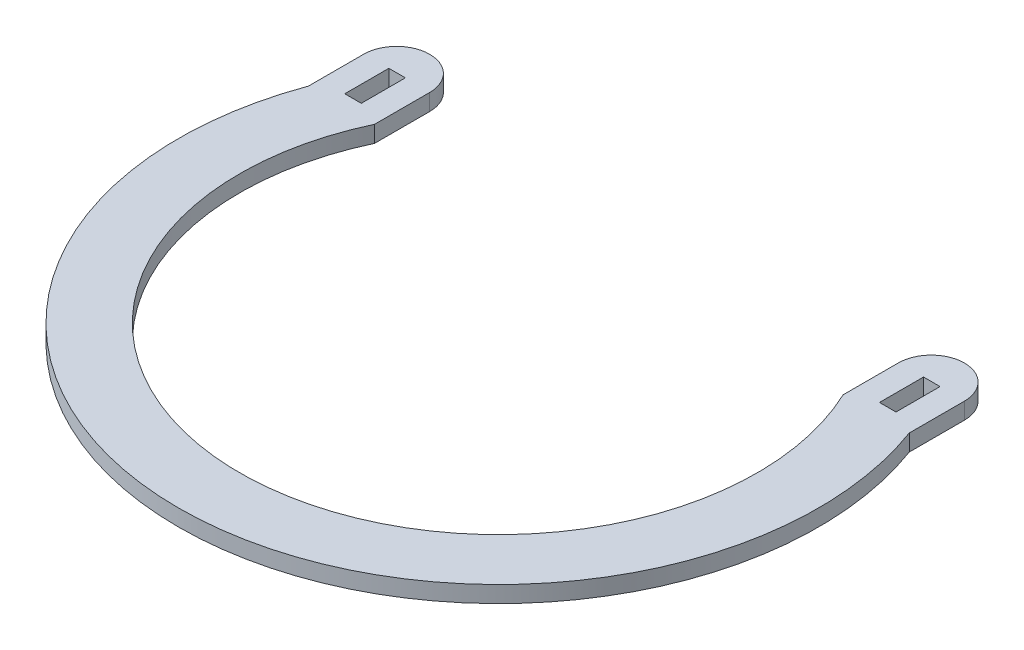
ISO-10303-21;
HEADER;
FILE_DESCRIPTION(('STEP AP214'),'2;1');
FILE_NAME('part.step','',(''),(''),'','','');
FILE_SCHEMA(('AUTOMOTIVE_DESIGN { 1 0 10303 214 1 1 1 1 }'));
ENDSEC;
DATA;
#1=APPLICATION_CONTEXT('core data for automotive mechanical design processes');
#2=APPLICATION_PROTOCOL_DEFINITION('international standard','automotive_design',2000,#1);
#3=PRODUCT_CONTEXT('',#1,'mechanical');
#4=PRODUCT('Part','Part','',(#3));
#5=PRODUCT_RELATED_PRODUCT_CATEGORY('part','',(#4));
#6=PRODUCT_DEFINITION_FORMATION('','',#4);
#7=PRODUCT_DEFINITION_CONTEXT('part definition',#1,'design');
#8=PRODUCT_DEFINITION('design','',#6,#7);
#9=PRODUCT_DEFINITION_SHAPE('','',#8);
#10=(LENGTH_UNIT() NAMED_UNIT(*) SI_UNIT(.MILLI.,.METRE.));
#11=(NAMED_UNIT(*) PLANE_ANGLE_UNIT() SI_UNIT($,.RADIAN.));
#12=(NAMED_UNIT(*) SI_UNIT($,.STERADIAN.) SOLID_ANGLE_UNIT());
#13=UNCERTAINTY_MEASURE_WITH_UNIT(LENGTH_MEASURE(1.E-05),#10,'distance_accuracy_value','');
#14=(GEOMETRIC_REPRESENTATION_CONTEXT(3) GLOBAL_UNCERTAINTY_ASSIGNED_CONTEXT((#13)) GLOBAL_UNIT_ASSIGNED_CONTEXT((#10,
#11,#12)) REPRESENTATION_CONTEXT('',''));
#15=CARTESIAN_POINT('',(0.,0.,0.));
#16=DIRECTION('',(0.,0.,1.));
#17=DIRECTION('',(1.,0.,0.));
#18=AXIS2_PLACEMENT_3D('',#15,#16,#17);
#19=CARTESIAN_POINT('',(-48.5,3.,-30.013068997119));
#20=DIRECTION('',(0.,-1.,0.));
#21=DIRECTION('',(0.,0.,-1.));
#22=AXIS2_PLACEMENT_3D('',#19,#20,#21);
#23=PLANE('',#22);
#24=DIRECTION('',(1.,0.,0.));
#25=VECTOR('',#24,1.);
#26=CARTESIAN_POINT('',(47.0000000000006,3.,-22.1046948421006));
#27=LINE('',#26,#25);
#28=CARTESIAN_POINT('',(47.0000000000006,3.,-22.1046948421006));
#29=VERTEX_POINT('',#28);
#30=CARTESIAN_POINT('',(50.0000000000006,3.,-22.1046948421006));
#31=VERTEX_POINT('',#30);
#32=EDGE_CURVE('E181',#29,#31,#27,.T.);
#33=ORIENTED_EDGE('',*,*,#32,.F.);
#34=DIRECTION('',(0.,0.,1.));
#35=VECTOR('',#34,1.);
#36=CARTESIAN_POINT('',(47.0000000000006,3.,-22.1046948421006));
#37=LINE('',#36,#35);
#38=CARTESIAN_POINT('',(47.0000000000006,3.,-30.1046948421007));
#39=VERTEX_POINT('',#38);
#40=EDGE_CURVE('E189',#39,#29,#37,.T.);
#41=ORIENTED_EDGE('',*,*,#40,.F.);
#42=DIRECTION('',(-1.,0.,0.));
#43=VECTOR('',#42,1.);
#44=CARTESIAN_POINT('',(47.0000000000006,3.,-30.1046948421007));
#45=LINE('',#44,#43);
#46=CARTESIAN_POINT('',(50.0000000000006,3.,-30.1046948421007));
#47=VERTEX_POINT('',#46);
#48=EDGE_CURVE('E186',#47,#39,#45,.T.);
#49=ORIENTED_EDGE('',*,*,#48,.F.);
#50=DIRECTION('',(0.,0.,-1.));
#51=VECTOR('',#50,1.);
#52=CARTESIAN_POINT('',(50.0000000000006,3.,-22.1046948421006));
#53=LINE('',#52,#51);
#54=EDGE_CURVE('E183',#31,#47,#53,.T.);
#55=ORIENTED_EDGE('',*,*,#54,.F.);
#56=EDGE_LOOP('',(#33,#41,#49,#55));
#57=FACE_BOUND('',#56,.T.);
#58=CARTESIAN_POINT('',(-48.5,3.,-30.013068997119));
#59=DIRECTION('',(0.,1.,0.));
#60=DIRECTION('',(0.,0.,-1.));
#61=AXIS2_PLACEMENT_3D('',#58,#59,#60);
#62=CIRCLE('',#61,6.);
#63=CARTESIAN_POINT('',(-42.5,3.,-30.013068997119));
#64=VERTEX_POINT('',#63);
#65=CARTESIAN_POINT('',(-54.5,3.,-30.013068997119));
#66=VERTEX_POINT('',#65);
#67=EDGE_CURVE('E212',#64,#66,#62,.T.);
#68=ORIENTED_EDGE('',*,*,#67,.T.);
#69=DIRECTION('',(0.,0.,1.));
#70=VECTOR('',#69,1.);
#71=CARTESIAN_POINT('',(-54.5,3.,-20.013068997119));
#72=LINE('',#71,#70);
#73=CARTESIAN_POINT('',(-54.5000000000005,3.,-20.0130689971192));
#74=VERTEX_POINT('',#73);
#75=EDGE_CURVE('E215',#66,#74,#72,.T.);
#76=ORIENTED_EDGE('',*,*,#75,.T.);
#77=CARTESIAN_POINT('',(0.,3.,0.));
#78=DIRECTION('',(0.,1.,0.));
#79=DIRECTION('',(0.,0.,1.));
#80=AXIS2_PLACEMENT_3D('',#77,#78,#79);
#81=CIRCLE('',#80,58.0583579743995);
#82=CARTESIAN_POINT('',(54.5000000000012,3.,-20.013068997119));
#83=VERTEX_POINT('',#82);
#84=EDGE_CURVE('E218',#74,#83,#81,.T.);
#85=ORIENTED_EDGE('',*,*,#84,.T.);
#86=DIRECTION('',(0.,0.,-1.));
#87=VECTOR('',#86,1.);
#88=CARTESIAN_POINT('',(54.5000000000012,3.,-20.013068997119));
#89=LINE('',#88,#87);
#90=CARTESIAN_POINT('',(54.5000000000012,3.,-30.013068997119));
#91=VERTEX_POINT('',#90);
#92=EDGE_CURVE('E220',#83,#91,#89,.T.);
#93=ORIENTED_EDGE('',*,*,#92,.T.);
#94=CARTESIAN_POINT('',(48.5000000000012,3.,-30.013068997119));
#95=DIRECTION('',(0.,1.,0.));
#96=DIRECTION('',(0.,0.,1.));
#97=AXIS2_PLACEMENT_3D('',#94,#95,#96);
#98=CIRCLE('',#97,6.);
#99=CARTESIAN_POINT('',(42.5000000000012,3.,-30.013068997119));
#100=VERTEX_POINT('',#99);
#101=EDGE_CURVE('E222',#91,#100,#98,.T.);
#102=ORIENTED_EDGE('',*,*,#101,.T.);
#103=DIRECTION('',(0.,0.,1.));
#104=VECTOR('',#103,1.);
#105=CARTESIAN_POINT('',(42.5000000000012,3.,-30.013068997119));
#106=LINE('',#105,#104);
#107=CARTESIAN_POINT('',(42.5000000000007,3.,-20.0130689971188));
#108=VERTEX_POINT('',#107);
#109=EDGE_CURVE('E224',#100,#108,#106,.T.);
#110=ORIENTED_EDGE('',*,*,#109,.T.);
#111=CARTESIAN_POINT('',(0.,3.,0.));
#112=DIRECTION('',(0.,-1.,0.));
#113=DIRECTION('',(0.,0.,1.));
#114=AXIS2_PLACEMENT_3D('',#111,#112,#113);
#115=CIRCLE('',#114,46.9763017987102);
#116=CARTESIAN_POINT('',(-42.5,3.,-20.013068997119));
#117=VERTEX_POINT('',#116);
#118=EDGE_CURVE('E226',#108,#117,#115,.T.);
#119=ORIENTED_EDGE('',*,*,#118,.T.);
#120=DIRECTION('',(0.,0.,-1.));
#121=VECTOR('',#120,1.);
#122=CARTESIAN_POINT('',(-42.5,3.,-30.013068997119));
#123=LINE('',#122,#121);
#124=EDGE_CURVE('E228',#117,#64,#123,.T.);
#125=ORIENTED_EDGE('',*,*,#124,.T.);
#126=EDGE_LOOP('',(#68,#76,#85,#93,#102,#110,#119,#125));
#127=FACE_BOUND('',#126,.T.);
#128=DIRECTION('',(0.,0.,-1.));
#129=VECTOR('',#128,1.);
#130=CARTESIAN_POINT('',(-47.0000000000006,3.,-22.1046948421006));
#131=LINE('',#130,#129);
#132=CARTESIAN_POINT('',(-47.0000000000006,3.,-22.1046948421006));
#133=VERTEX_POINT('',#132);
#134=CARTESIAN_POINT('',(-47.0000000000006,3.,-30.1046948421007));
#135=VERTEX_POINT('',#134);
#136=EDGE_CURVE('E145',#133,#135,#131,.T.);
#137=ORIENTED_EDGE('',*,*,#136,.F.);
#138=DIRECTION('',(1.,0.,0.));
#139=VECTOR('',#138,1.);
#140=CARTESIAN_POINT('',(-47.0000000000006,3.,-22.1046948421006));
#141=LINE('',#140,#139);
#142=CARTESIAN_POINT('',(-50.0000000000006,3.,-22.1046948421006));
#143=VERTEX_POINT('',#142);
#144=EDGE_CURVE('E167',#143,#133,#141,.T.);
#145=ORIENTED_EDGE('',*,*,#144,.F.);
#146=DIRECTION('',(0.,0.,1.));
#147=VECTOR('',#146,1.);
#148=CARTESIAN_POINT('',(-50.0000000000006,3.,-22.1046948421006));
#149=LINE('',#148,#147);
#150=CARTESIAN_POINT('',(-50.0000000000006,3.,-30.1046948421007));
#151=VERTEX_POINT('',#150);
#152=EDGE_CURVE('E165',#151,#143,#149,.T.);
#153=ORIENTED_EDGE('',*,*,#152,.F.);
#154=DIRECTION('',(-1.,0.,0.));
#155=VECTOR('',#154,1.);
#156=CARTESIAN_POINT('',(-47.0000000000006,3.,-30.1046948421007));
#157=LINE('',#156,#155);
#158=EDGE_CURVE('E153',#135,#151,#157,.T.);
#159=ORIENTED_EDGE('',*,*,#158,.F.);
#160=EDGE_LOOP('',(#137,#145,#153,#159));
#161=FACE_BOUND('',#160,.T.);
#162=ADVANCED_FACE('F32',(#57,#127,#161),#23,.F.);
#163=CARTESIAN_POINT('',(-48.5,0.,-30.013068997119));
#164=DIRECTION('',(0.,-1.,0.));
#165=DIRECTION('',(0.,0.,-1.));
#166=AXIS2_PLACEMENT_3D('',#163,#164,#165);
#167=PLANE('',#166);
#168=CARTESIAN_POINT('',(-48.5,0.,-30.013068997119));
#169=DIRECTION('',(0.,1.,0.));
#170=DIRECTION('',(0.,0.,-1.));
#171=AXIS2_PLACEMENT_3D('',#168,#169,#170);
#172=CIRCLE('',#171,6.);
#173=CARTESIAN_POINT('',(-42.5,0.,-30.013068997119));
#174=VERTEX_POINT('',#173);
#175=CARTESIAN_POINT('',(-54.5,0.,-30.013068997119));
#176=VERTEX_POINT('',#175);
#177=EDGE_CURVE('E211',#174,#176,#172,.T.);
#178=ORIENTED_EDGE('',*,*,#177,.F.);
#179=DIRECTION('',(0.,0.,-1.));
#180=VECTOR('',#179,1.);
#181=CARTESIAN_POINT('',(-42.5,0.,-30.013068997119));
#182=LINE('',#181,#180);
#183=CARTESIAN_POINT('',(-42.5,0.,-20.013068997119));
#184=VERTEX_POINT('',#183);
#185=EDGE_CURVE('E216',#184,#174,#182,.T.);
#186=ORIENTED_EDGE('',*,*,#185,.F.);
#187=CARTESIAN_POINT('',(0.,0.,0.));
#188=DIRECTION('',(0.,-1.,0.));
#189=DIRECTION('',(0.,0.,1.));
#190=AXIS2_PLACEMENT_3D('',#187,#188,#189);
#191=CIRCLE('',#190,46.9763017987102);
#192=CARTESIAN_POINT('',(42.5000000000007,0.,-20.0130689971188));
#193=VERTEX_POINT('',#192);
#194=EDGE_CURVE('E243',#193,#184,#191,.T.);
#195=ORIENTED_EDGE('',*,*,#194,.F.);
#196=DIRECTION('',(0.,0.,1.));
#197=VECTOR('',#196,1.);
#198=CARTESIAN_POINT('',(42.5000000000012,0.,-30.013068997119));
#199=LINE('',#198,#197);
#200=CARTESIAN_POINT('',(42.5000000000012,0.,-30.013068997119));
#201=VERTEX_POINT('',#200);
#202=EDGE_CURVE('E241',#201,#193,#199,.T.);
#203=ORIENTED_EDGE('',*,*,#202,.F.);
#204=CARTESIAN_POINT('',(48.5000000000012,0.,-30.013068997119));
#205=DIRECTION('',(0.,1.,0.));
#206=DIRECTION('',(0.,0.,1.));
#207=AXIS2_PLACEMENT_3D('',#204,#205,#206);
#208=CIRCLE('',#207,6.);
#209=CARTESIAN_POINT('',(54.5000000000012,0.,-30.013068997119));
#210=VERTEX_POINT('',#209);
#211=EDGE_CURVE('E239',#210,#201,#208,.T.);
#212=ORIENTED_EDGE('',*,*,#211,.F.);
#213=DIRECTION('',(0.,0.,-1.));
#214=VECTOR('',#213,1.);
#215=CARTESIAN_POINT('',(54.5000000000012,0.,-20.013068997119));
#216=LINE('',#215,#214);
#217=CARTESIAN_POINT('',(54.5000000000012,0.,-20.013068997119));
#218=VERTEX_POINT('',#217);
#219=EDGE_CURVE('E237',#218,#210,#216,.T.);
#220=ORIENTED_EDGE('',*,*,#219,.F.);
#221=CARTESIAN_POINT('',(0.,0.,0.));
#222=DIRECTION('',(0.,1.,0.));
#223=DIRECTION('',(0.,0.,1.));
#224=AXIS2_PLACEMENT_3D('',#221,#222,#223);
#225=CIRCLE('',#224,58.0583579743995);
#226=CARTESIAN_POINT('',(-54.5000000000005,0.,-20.0130689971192));
#227=VERTEX_POINT('',#226);
#228=EDGE_CURVE('E235',#227,#218,#225,.T.);
#229=ORIENTED_EDGE('',*,*,#228,.F.);
#230=DIRECTION('',(0.,0.,1.));
#231=VECTOR('',#230,1.);
#232=CARTESIAN_POINT('',(-54.5,0.,-20.013068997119));
#233=LINE('',#232,#231);
#234=EDGE_CURVE('E233',#176,#227,#233,.T.);
#235=ORIENTED_EDGE('',*,*,#234,.F.);
#236=EDGE_LOOP('',(#178,#186,#195,#203,#212,#220,#229,#235));
#237=FACE_BOUND('',#236,.T.);
#238=DIRECTION('',(0.,0.,1.));
#239=VECTOR('',#238,1.);
#240=CARTESIAN_POINT('',(47.0000000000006,0.,-22.1046948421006));
#241=LINE('',#240,#239);
#242=CARTESIAN_POINT('',(47.0000000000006,0.,-30.1046948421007));
#243=VERTEX_POINT('',#242);
#244=CARTESIAN_POINT('',(47.0000000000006,0.,-22.1046948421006));
#245=VERTEX_POINT('',#244);
#246=EDGE_CURVE('E184',#243,#245,#241,.T.);
#247=ORIENTED_EDGE('',*,*,#246,.T.);
#248=DIRECTION('',(1.,0.,0.));
#249=VECTOR('',#248,1.);
#250=CARTESIAN_POINT('',(47.0000000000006,0.,-22.1046948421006));
#251=LINE('',#250,#249);
#252=CARTESIAN_POINT('',(50.0000000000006,0.,-22.1046948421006));
#253=VERTEX_POINT('',#252);
#254=EDGE_CURVE('E161',#245,#253,#251,.T.);
#255=ORIENTED_EDGE('',*,*,#254,.T.);
#256=DIRECTION('',(0.,0.,-1.));
#257=VECTOR('',#256,1.);
#258=CARTESIAN_POINT('',(50.0000000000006,0.,-22.1046948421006));
#259=LINE('',#258,#257);
#260=CARTESIAN_POINT('',(50.0000000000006,0.,-30.1046948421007));
#261=VERTEX_POINT('',#260);
#262=EDGE_CURVE('E194',#253,#261,#259,.T.);
#263=ORIENTED_EDGE('',*,*,#262,.T.);
#264=DIRECTION('',(-1.,0.,0.));
#265=VECTOR('',#264,1.);
#266=CARTESIAN_POINT('',(47.0000000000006,0.,-30.1046948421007));
#267=LINE('',#266,#265);
#268=EDGE_CURVE('E197',#261,#243,#267,.T.);
#269=ORIENTED_EDGE('',*,*,#268,.T.);
#270=EDGE_LOOP('',(#247,#255,#263,#269));
#271=FACE_BOUND('',#270,.T.);
#272=DIRECTION('',(1.,0.,0.));
#273=VECTOR('',#272,1.);
#274=CARTESIAN_POINT('',(-47.0000000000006,0.,-22.1046948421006));
#275=LINE('',#274,#273);
#276=CARTESIAN_POINT('',(-50.0000000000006,0.,-22.1046948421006));
#277=VERTEX_POINT('',#276);
#278=CARTESIAN_POINT('',(-47.0000000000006,0.,-22.1046948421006));
#279=VERTEX_POINT('',#278);
#280=EDGE_CURVE('E154',#277,#279,#275,.T.);
#281=ORIENTED_EDGE('',*,*,#280,.T.);
#282=DIRECTION('',(0.,0.,-1.));
#283=VECTOR('',#282,1.);
#284=CARTESIAN_POINT('',(-47.0000000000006,0.,-22.1046948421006));
#285=LINE('',#284,#283);
#286=CARTESIAN_POINT('',(-47.0000000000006,0.,-30.1046948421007));
#287=VERTEX_POINT('',#286);
#288=EDGE_CURVE('E55',#279,#287,#285,.T.);
#289=ORIENTED_EDGE('',*,*,#288,.T.);
#290=DIRECTION('',(-1.,0.,0.));
#291=VECTOR('',#290,1.);
#292=CARTESIAN_POINT('',(-47.0000000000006,0.,-30.1046948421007));
#293=LINE('',#292,#291);
#294=CARTESIAN_POINT('',(-50.0000000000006,0.,-30.1046948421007));
#295=VERTEX_POINT('',#294);
#296=EDGE_CURVE('E160',#287,#295,#293,.T.);
#297=ORIENTED_EDGE('',*,*,#296,.T.);
#298=DIRECTION('',(0.,0.,1.));
#299=VECTOR('',#298,1.);
#300=CARTESIAN_POINT('',(-50.0000000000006,0.,-22.1046948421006));
#301=LINE('',#300,#299);
#302=EDGE_CURVE('E173',#295,#277,#301,.T.);
#303=ORIENTED_EDGE('',*,*,#302,.T.);
#304=EDGE_LOOP('',(#281,#289,#297,#303));
#305=FACE_BOUND('',#304,.T.);
#306=ADVANCED_FACE('F273',(#237,#271,#305),#167,.T.);
#307=CARTESIAN_POINT('',(-48.5,3.,-30.013068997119));
#308=DIRECTION('',(0.,-1.,0.));
#309=DIRECTION('',(0.,0.,-1.));
#310=AXIS2_PLACEMENT_3D('',#307,#308,#309);
#311=CYLINDRICAL_SURFACE('',#310,6.);
#312=ORIENTED_EDGE('',*,*,#177,.T.);
#313=DIRECTION('',(0.,-1.,0.));
#314=VECTOR('',#313,1.);
#315=CARTESIAN_POINT('',(-54.5,3.,-30.013068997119));
#316=LINE('',#315,#314);
#317=EDGE_CURVE('E11',#66,#176,#316,.T.);
#318=ORIENTED_EDGE('',*,*,#317,.F.);
#319=ORIENTED_EDGE('',*,*,#67,.F.);
#320=DIRECTION('',(0.,-1.,0.));
#321=VECTOR('',#320,1.);
#322=CARTESIAN_POINT('',(-42.5,3.,-30.013068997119));
#323=LINE('',#322,#321);
#324=EDGE_CURVE('E230',#64,#174,#323,.T.);
#325=ORIENTED_EDGE('',*,*,#324,.T.);
#326=EDGE_LOOP('',(#312,#318,#319,#325));
#327=FACE_BOUND('',#326,.T.);
#328=ADVANCED_FACE('F34',(#327),#311,.T.);
#329=CARTESIAN_POINT('',(-54.5,3.,-20.013068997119));
#330=DIRECTION('',(1.,0.,0.));
#331=DIRECTION('',(0.,0.,-1.));
#332=AXIS2_PLACEMENT_3D('',#329,#330,#331);
#333=PLANE('',#332);
#334=ORIENTED_EDGE('',*,*,#234,.T.);
#335=DIRECTION('',(0.,-1.,0.));
#336=VECTOR('',#335,1.);
#337=CARTESIAN_POINT('',(-54.5000000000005,3.,-20.0130689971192));
#338=LINE('',#337,#336);
#339=EDGE_CURVE('E40',#74,#227,#338,.T.);
#340=ORIENTED_EDGE('',*,*,#339,.F.);
#341=ORIENTED_EDGE('',*,*,#75,.F.);
#342=ORIENTED_EDGE('',*,*,#317,.T.);
#343=EDGE_LOOP('',(#334,#340,#341,#342));
#344=FACE_BOUND('',#343,.T.);
#345=ADVANCED_FACE('F290',(#344),#333,.F.);
#346=CARTESIAN_POINT('',(0.,3.,0.));
#347=DIRECTION('',(0.,-1.,0.));
#348=DIRECTION('',(0.,0.,-1.));
#349=AXIS2_PLACEMENT_3D('',#346,#347,#348);
#350=CYLINDRICAL_SURFACE('',#349,58.0583579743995);
#351=ORIENTED_EDGE('',*,*,#228,.T.);
#352=DIRECTION('',(0.,-1.,0.));
#353=VECTOR('',#352,1.);
#354=CARTESIAN_POINT('',(54.5000000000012,3.,-20.013068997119));
#355=LINE('',#354,#353);
#356=EDGE_CURVE('E260',#83,#218,#355,.T.);
#357=ORIENTED_EDGE('',*,*,#356,.F.);
#358=ORIENTED_EDGE('',*,*,#84,.F.);
#359=ORIENTED_EDGE('',*,*,#339,.T.);
#360=EDGE_LOOP('',(#351,#357,#358,#359));
#361=FACE_BOUND('',#360,.T.);
#362=ADVANCED_FACE('F267',(#361),#350,.T.);
#363=CARTESIAN_POINT('',(54.5000000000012,3.,-20.013068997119));
#364=DIRECTION('',(-1.,0.,0.));
#365=DIRECTION('',(0.,0.,1.));
#366=AXIS2_PLACEMENT_3D('',#363,#364,#365);
#367=PLANE('',#366);
#368=ORIENTED_EDGE('',*,*,#219,.T.);
#369=DIRECTION('',(0.,-1.,0.));
#370=VECTOR('',#369,1.);
#371=CARTESIAN_POINT('',(54.5000000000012,3.,-30.013068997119));
#372=LINE('',#371,#370);
#373=EDGE_CURVE('E257',#91,#210,#372,.T.);
#374=ORIENTED_EDGE('',*,*,#373,.F.);
#375=ORIENTED_EDGE('',*,*,#92,.F.);
#376=ORIENTED_EDGE('',*,*,#356,.T.);
#377=EDGE_LOOP('',(#368,#374,#375,#376));
#378=FACE_BOUND('',#377,.T.);
#379=ADVANCED_FACE('F279',(#378),#367,.F.);
#380=CARTESIAN_POINT('',(48.5000000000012,3.,-30.013068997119));
#381=DIRECTION('',(0.,-1.,0.));
#382=DIRECTION('',(0.,0.,-1.));
#383=AXIS2_PLACEMENT_3D('',#380,#381,#382);
#384=CYLINDRICAL_SURFACE('',#383,6.);
#385=ORIENTED_EDGE('',*,*,#211,.T.);
#386=DIRECTION('',(0.,-1.,0.));
#387=VECTOR('',#386,1.);
#388=CARTESIAN_POINT('',(42.5000000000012,3.,-30.013068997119));
#389=LINE('',#388,#387);
#390=EDGE_CURVE('E254',#100,#201,#389,.T.);
#391=ORIENTED_EDGE('',*,*,#390,.F.);
#392=ORIENTED_EDGE('',*,*,#101,.F.);
#393=ORIENTED_EDGE('',*,*,#373,.T.);
#394=EDGE_LOOP('',(#385,#391,#392,#393));
#395=FACE_BOUND('',#394,.T.);
#396=ADVANCED_FACE('F283',(#395),#384,.T.);
#397=CARTESIAN_POINT('',(42.5000000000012,3.,-30.013068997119));
#398=DIRECTION('',(1.,0.,0.));
#399=DIRECTION('',(0.,0.,-1.));
#400=AXIS2_PLACEMENT_3D('',#397,#398,#399);
#401=PLANE('',#400);
#402=ORIENTED_EDGE('',*,*,#202,.T.);
#403=DIRECTION('',(0.,-1.,0.));
#404=VECTOR('',#403,1.);
#405=CARTESIAN_POINT('',(42.5000000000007,3.,-20.0130689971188));
#406=LINE('',#405,#404);
#407=EDGE_CURVE('E251',#108,#193,#406,.T.);
#408=ORIENTED_EDGE('',*,*,#407,.F.);
#409=ORIENTED_EDGE('',*,*,#109,.F.);
#410=ORIENTED_EDGE('',*,*,#390,.T.);
#411=EDGE_LOOP('',(#402,#408,#409,#410));
#412=FACE_BOUND('',#411,.T.);
#413=ADVANCED_FACE('F303',(#412),#401,.F.);
#414=CARTESIAN_POINT('',(0.,3.,0.));
#415=DIRECTION('',(0.,-1.,0.));
#416=DIRECTION('',(0.,0.,-1.));
#417=AXIS2_PLACEMENT_3D('',#414,#415,#416);
#418=CYLINDRICAL_SURFACE('',#417,46.9763017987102);
#419=ORIENTED_EDGE('',*,*,#194,.T.);
#420=DIRECTION('',(0.,-1.,0.));
#421=VECTOR('',#420,1.);
#422=CARTESIAN_POINT('',(-42.5,3.,-20.013068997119));
#423=LINE('',#422,#421);
#424=EDGE_CURVE('E248',#117,#184,#423,.T.);
#425=ORIENTED_EDGE('',*,*,#424,.F.);
#426=ORIENTED_EDGE('',*,*,#118,.F.);
#427=ORIENTED_EDGE('',*,*,#407,.T.);
#428=EDGE_LOOP('',(#419,#425,#426,#427));
#429=FACE_BOUND('',#428,.T.);
#430=ADVANCED_FACE('F301',(#429),#418,.F.);
#431=CARTESIAN_POINT('',(-42.5,3.,-30.013068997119));
#432=DIRECTION('',(-1.,0.,0.));
#433=DIRECTION('',(0.,0.,1.));
#434=AXIS2_PLACEMENT_3D('',#431,#432,#433);
#435=PLANE('',#434);
#436=ORIENTED_EDGE('',*,*,#185,.T.);
#437=ORIENTED_EDGE('',*,*,#324,.F.);
#438=ORIENTED_EDGE('',*,*,#124,.F.);
#439=ORIENTED_EDGE('',*,*,#424,.T.);
#440=EDGE_LOOP('',(#436,#437,#438,#439));
#441=FACE_BOUND('',#440,.T.);
#442=ADVANCED_FACE('F296',(#441),#435,.F.);
#443=CARTESIAN_POINT('',(47.0000000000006,3.,-22.1046948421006));
#444=DIRECTION('',(0.,0.,-1.));
#445=DIRECTION('',(-1.,0.,0.));
#446=AXIS2_PLACEMENT_3D('',#443,#444,#445);
#447=PLANE('',#446);
#448=ORIENTED_EDGE('',*,*,#254,.F.);
#449=DIRECTION('',(0.,-1.,0.));
#450=VECTOR('',#449,1.);
#451=CARTESIAN_POINT('',(47.0000000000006,3.,-22.1046948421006));
#452=LINE('',#451,#450);
#453=EDGE_CURVE('E191',#29,#245,#452,.T.);
#454=ORIENTED_EDGE('',*,*,#453,.F.);
#455=ORIENTED_EDGE('',*,*,#32,.T.);
#456=DIRECTION('',(0.,-1.,0.));
#457=VECTOR('',#456,1.);
#458=CARTESIAN_POINT('',(50.0000000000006,3.,-22.1046948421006));
#459=LINE('',#458,#457);
#460=EDGE_CURVE('E208',#31,#253,#459,.T.);
#461=ORIENTED_EDGE('',*,*,#460,.T.);
#462=EDGE_LOOP('',(#448,#454,#455,#461));
#463=FACE_BOUND('',#462,.T.);
#464=ADVANCED_FACE('F321',(#463),#447,.T.);
#465=CARTESIAN_POINT('',(50.0000000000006,3.,-22.1046948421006));
#466=DIRECTION('',(-1.,0.,0.));
#467=DIRECTION('',(0.,0.,1.));
#468=AXIS2_PLACEMENT_3D('',#465,#466,#467);
#469=PLANE('',#468);
#470=ORIENTED_EDGE('',*,*,#262,.F.);
#471=ORIENTED_EDGE('',*,*,#460,.F.);
#472=ORIENTED_EDGE('',*,*,#54,.T.);
#473=DIRECTION('',(0.,-1.,0.));
#474=VECTOR('',#473,1.);
#475=CARTESIAN_POINT('',(50.0000000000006,3.,-30.1046948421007));
#476=LINE('',#475,#474);
#477=EDGE_CURVE('E206',#47,#261,#476,.T.);
#478=ORIENTED_EDGE('',*,*,#477,.T.);
#479=EDGE_LOOP('',(#470,#471,#472,#478));
#480=FACE_BOUND('',#479,.T.);
#481=ADVANCED_FACE('F328',(#480),#469,.T.);
#482=CARTESIAN_POINT('',(47.0000000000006,3.,-30.1046948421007));
#483=DIRECTION('',(0.,0.,1.));
#484=DIRECTION('',(1.,0.,0.));
#485=AXIS2_PLACEMENT_3D('',#482,#483,#484);
#486=PLANE('',#485);
#487=ORIENTED_EDGE('',*,*,#268,.F.);
#488=ORIENTED_EDGE('',*,*,#477,.F.);
#489=ORIENTED_EDGE('',*,*,#48,.T.);
#490=DIRECTION('',(0.,-1.,0.));
#491=VECTOR('',#490,1.);
#492=CARTESIAN_POINT('',(47.0000000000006,3.,-30.1046948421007));
#493=LINE('',#492,#491);
#494=EDGE_CURVE('E204',#39,#243,#493,.T.);
#495=ORIENTED_EDGE('',*,*,#494,.T.);
#496=EDGE_LOOP('',(#487,#488,#489,#495));
#497=FACE_BOUND('',#496,.T.);
#498=ADVANCED_FACE('F333',(#497),#486,.T.);
#499=CARTESIAN_POINT('',(47.0000000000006,3.,-22.1046948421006));
#500=DIRECTION('',(1.,0.,0.));
#501=DIRECTION('',(0.,0.,-1.));
#502=AXIS2_PLACEMENT_3D('',#499,#500,#501);
#503=PLANE('',#502);
#504=ORIENTED_EDGE('',*,*,#246,.F.);
#505=ORIENTED_EDGE('',*,*,#494,.F.);
#506=ORIENTED_EDGE('',*,*,#40,.T.);
#507=ORIENTED_EDGE('',*,*,#453,.T.);
#508=EDGE_LOOP('',(#504,#505,#506,#507));
#509=FACE_BOUND('',#508,.T.);
#510=ADVANCED_FACE('F339',(#509),#503,.T.);
#511=CARTESIAN_POINT('',(-47.0000000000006,3.,-22.1046948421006));
#512=DIRECTION('',(-1.,0.,0.));
#513=DIRECTION('',(0.,0.,1.));
#514=AXIS2_PLACEMENT_3D('',#511,#512,#513);
#515=PLANE('',#514);
#516=ORIENTED_EDGE('',*,*,#288,.F.);
#517=DIRECTION('',(0.,-1.,0.));
#518=VECTOR('',#517,1.);
#519=CARTESIAN_POINT('',(-47.0000000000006,3.,-22.1046948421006));
#520=LINE('',#519,#518);
#521=EDGE_CURVE('E149',#133,#279,#520,.T.);
#522=ORIENTED_EDGE('',*,*,#521,.F.);
#523=ORIENTED_EDGE('',*,*,#136,.T.);
#524=DIRECTION('',(0.,-1.,0.));
#525=VECTOR('',#524,1.);
#526=CARTESIAN_POINT('',(-47.0000000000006,3.,-30.1046948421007));
#527=LINE('',#526,#525);
#528=EDGE_CURVE('E148',#135,#287,#527,.T.);
#529=ORIENTED_EDGE('',*,*,#528,.T.);
#530=EDGE_LOOP('',(#516,#522,#523,#529));
#531=FACE_BOUND('',#530,.T.);
#532=ADVANCED_FACE('F147',(#531),#515,.T.);
#533=CARTESIAN_POINT('',(-47.0000000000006,3.,-30.1046948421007));
#534=DIRECTION('',(0.,0.,1.));
#535=DIRECTION('',(1.,0.,0.));
#536=AXIS2_PLACEMENT_3D('',#533,#534,#535);
#537=PLANE('',#536);
#538=ORIENTED_EDGE('',*,*,#296,.F.);
#539=ORIENTED_EDGE('',*,*,#528,.F.);
#540=ORIENTED_EDGE('',*,*,#158,.T.);
#541=DIRECTION('',(0.,-1.,0.));
#542=VECTOR('',#541,1.);
#543=CARTESIAN_POINT('',(-50.0000000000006,3.,-30.1046948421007));
#544=LINE('',#543,#542);
#545=EDGE_CURVE('E162',#151,#295,#544,.T.);
#546=ORIENTED_EDGE('',*,*,#545,.T.);
#547=EDGE_LOOP('',(#538,#539,#540,#546));
#548=FACE_BOUND('',#547,.T.);
#549=ADVANCED_FACE('F157',(#548),#537,.T.);
#550=CARTESIAN_POINT('',(-50.0000000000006,3.,-22.1046948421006));
#551=DIRECTION('',(1.,0.,0.));
#552=DIRECTION('',(0.,0.,-1.));
#553=AXIS2_PLACEMENT_3D('',#550,#551,#552);
#554=PLANE('',#553);
#555=ORIENTED_EDGE('',*,*,#302,.F.);
#556=ORIENTED_EDGE('',*,*,#545,.F.);
#557=ORIENTED_EDGE('',*,*,#152,.T.);
#558=DIRECTION('',(0.,-1.,0.));
#559=VECTOR('',#558,1.);
#560=CARTESIAN_POINT('',(-50.0000000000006,3.,-22.1046948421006));
#561=LINE('',#560,#559);
#562=EDGE_CURVE('E47',#143,#277,#561,.T.);
#563=ORIENTED_EDGE('',*,*,#562,.T.);
#564=EDGE_LOOP('',(#555,#556,#557,#563));
#565=FACE_BOUND('',#564,.T.);
#566=ADVANCED_FACE('F358',(#565),#554,.T.);
#567=CARTESIAN_POINT('',(-47.0000000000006,3.,-22.1046948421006));
#568=DIRECTION('',(0.,0.,-1.));
#569=DIRECTION('',(-1.,0.,0.));
#570=AXIS2_PLACEMENT_3D('',#567,#568,#569);
#571=PLANE('',#570);
#572=ORIENTED_EDGE('',*,*,#280,.F.);
#573=ORIENTED_EDGE('',*,*,#562,.F.);
#574=ORIENTED_EDGE('',*,*,#144,.T.);
#575=ORIENTED_EDGE('',*,*,#521,.T.);
#576=EDGE_LOOP('',(#572,#573,#574,#575));
#577=FACE_BOUND('',#576,.T.);
#578=ADVANCED_FACE('F361',(#577),#571,.T.);
#579=CLOSED_SHELL('',(#162,#306,#328,#345,#362,#379,#396,#413,#430,#442,#464,#481,#498,#510,
#532,#549,#566,#578));
#580=MANIFOLD_SOLID_BREP('B2',#579);
#581=ADVANCED_BREP_SHAPE_REPRESENTATION('',(#18,#580),#14);
#582=SHAPE_DEFINITION_REPRESENTATION(#9,#581);
ENDSEC;
END-ISO-10303-21;
